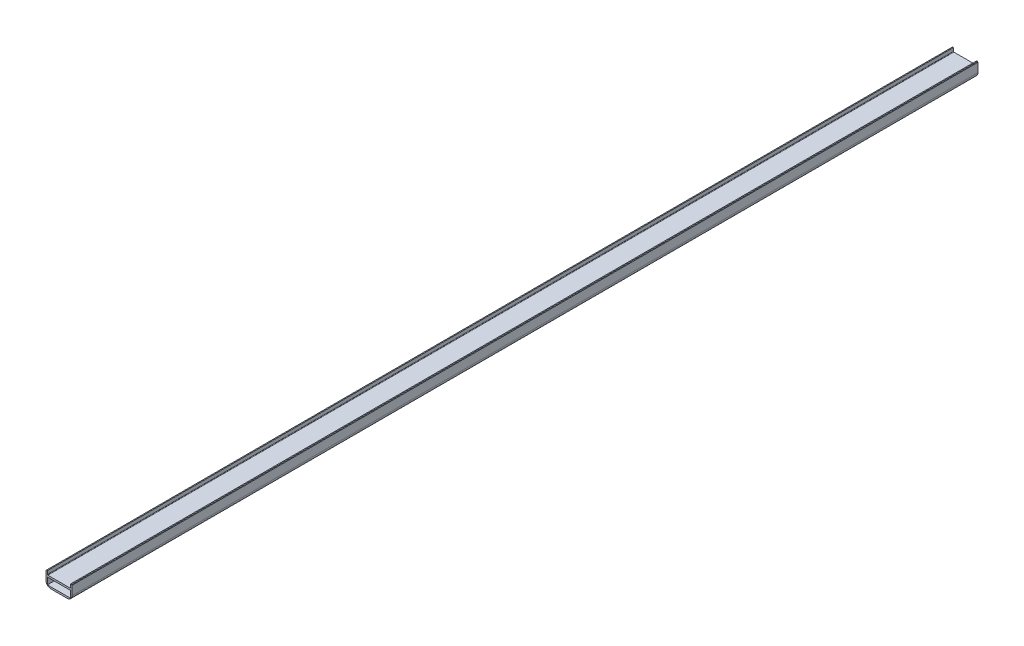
from build123d import *

# Parameters (mm, degrees)
BOSS_EXTRUDE1_DEPTH = 960
FILLET1_R           = 10
CHAMFER1_SIZE       = 1
SKETCH5_W           = 49
SKETCH5_H           = 14.388359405
CUT_EXTRUDE1_DEPTH  = 2007


with BuildPart() as part:
    # Sketch2 → Boss-Extrude1 (new, symmetric)
    with BuildSketch(Plane.XY):
        with BuildLine():
            Line((-24.5, 3.027741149), (-27.5, 3.027741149))
            Line((-27.5, 3.027741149), (-27.5, -26.972258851))
            Line((-27.5, -26.972258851), (27.5, -26.972258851))
            Line((27.5, -26.972258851), (27.5, 3.027741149))
            Line((27.5, 3.027741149), (24.5, 3.027741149))
            Line((24.5, 3.027741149), (24.5, -3.972258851))
            ThreePointArc((24.5, -3.972258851), (24.207106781, -4.679365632), (23.5, -4.972258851))
            Line((23.5, -4.972258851), (-23.5, -4.972258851))
            ThreePointArc((-23.5, -4.972258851), (-24.207106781, -4.679365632), (-24.5, -3.972258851))
            Line((-24.5, -3.972258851), (-24.5, 3.027741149))
        make_face()
    extrude(amount=BOSS_EXTRUDE1_DEPTH, both=True)

    # Fillet1
    fillet1_edges = [part.edges().sort_by_distance(p)[0] for p in [
        (27.5, -26.972258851, 0),
        (-27.5, -26.972258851, 0),
    ]]
    fillet(fillet1_edges, radius=FILLET1_R)

    # Chamfer1
    chamfer1_edges = [part.edges().sort_by_distance(p)[0] for p in [
        (27.5, 3.027741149, 0),
        (-27.5, 3.027741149, 0),
    ]]
    chamfer(chamfer1_edges, length=CHAMFER1_SIZE)

    # Sketch5 → Cut-Extrude1 (cut)
    with BuildSketch(Plane.XY.offset(960)):
        with Locations((0, -15.972258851)):
            Rectangle(SKETCH5_W, SKETCH5_H)
    extrude(amount=-CUT_EXTRUDE1_DEPTH, mode=Mode.SUBTRACT)


solid = part.part
